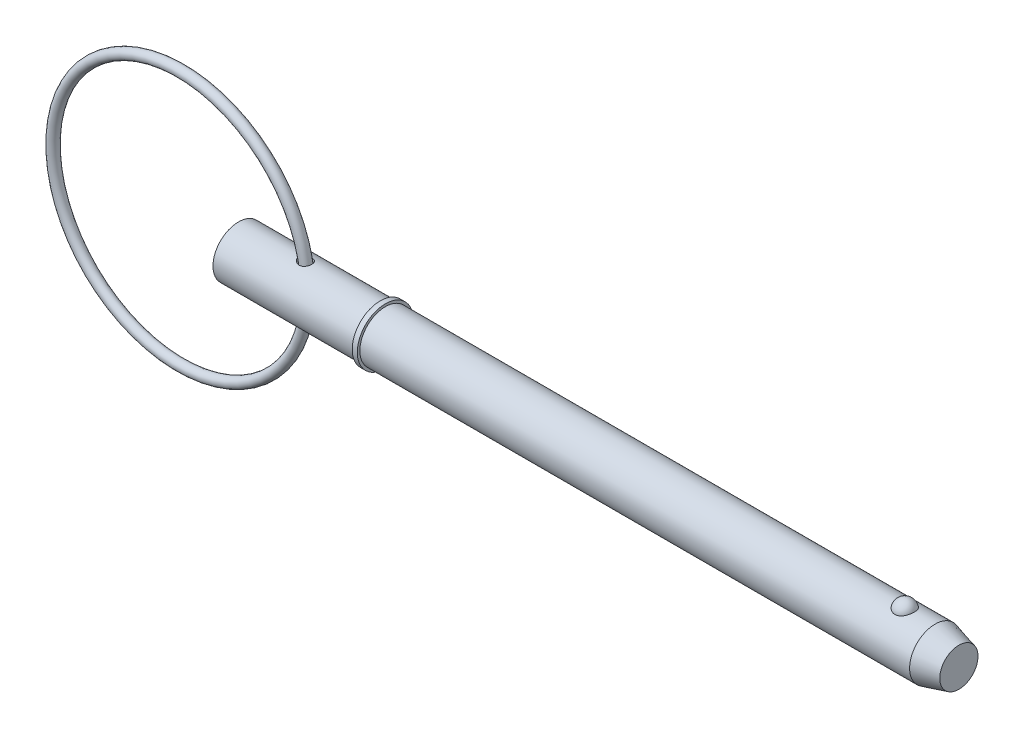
ISO-10303-21;
HEADER;
FILE_DESCRIPTION(('STEP AP214'),'2;1');
FILE_NAME('part.step','',(''),(''),'','','');
FILE_SCHEMA(('AUTOMOTIVE_DESIGN { 1 0 10303 214 1 1 1 1 }'));
ENDSEC;
DATA;
#1=APPLICATION_CONTEXT('core data for automotive mechanical design processes');
#2=APPLICATION_PROTOCOL_DEFINITION('international standard','automotive_design',2000,#1);
#3=PRODUCT_CONTEXT('',#1,'mechanical');
#4=PRODUCT('Part','Part','',(#3));
#5=PRODUCT_RELATED_PRODUCT_CATEGORY('part','',(#4));
#6=PRODUCT_DEFINITION_FORMATION('','',#4);
#7=PRODUCT_DEFINITION_CONTEXT('part definition',#1,'design');
#8=PRODUCT_DEFINITION('design','',#6,#7);
#9=PRODUCT_DEFINITION_SHAPE('','',#8);
#10=(LENGTH_UNIT() NAMED_UNIT(*) SI_UNIT(.MILLI.,.METRE.));
#11=(NAMED_UNIT(*) PLANE_ANGLE_UNIT() SI_UNIT($,.RADIAN.));
#12=(NAMED_UNIT(*) SI_UNIT($,.STERADIAN.) SOLID_ANGLE_UNIT());
#13=UNCERTAINTY_MEASURE_WITH_UNIT(LENGTH_MEASURE(1.E-05),#10,'distance_accuracy_value','');
#14=(GEOMETRIC_REPRESENTATION_CONTEXT(3) GLOBAL_UNCERTAINTY_ASSIGNED_CONTEXT((#13)) GLOBAL_UNIT_ASSIGNED_CONTEXT((#10,
#11,#12)) REPRESENTATION_CONTEXT('',''));
#15=CARTESIAN_POINT('',(0.,0.,0.));
#16=DIRECTION('',(0.,0.,1.));
#17=DIRECTION('',(1.,0.,0.));
#18=AXIS2_PLACEMENT_3D('',#15,#16,#17);
#19=CARTESIAN_POINT('',(-7.21857545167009,0.,0.));
#20=DIRECTION('',(0.,0.,1.));
#21=DIRECTION('',(1.,0.,0.));
#22=AXIS2_PLACEMENT_3D('',#19,#20,#21);
#23=TOROIDAL_SURFACE('',#22,15.875,0.634999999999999);
#24=CARTESIAN_POINT('',(9.29142454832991,0.,0.));
#25=VERTEX_POINT('',#24);
#26=VERTEX_LOOP('',#25);
#27=FACE_BOUND('',#26,.T.);
#28=ADVANCED_FACE('P0_F12',(#27),#23,.T.);
#29=CLOSED_SHELL('',(#28));
#30=MANIFOLD_SOLID_BREP('P0_B1',#29);
#31=CARTESIAN_POINT('',(0.,0.,0.));
#32=DIRECTION('',(1.,0.,0.));
#33=DIRECTION('',(0.,0.,-1.));
#34=AXIS2_PLACEMENT_3D('',#31,#32,#33);
#35=CYLINDRICAL_SURFACE('',#34,3.175);
#36=CARTESIAN_POINT('',(7.61208756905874,3.1556298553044,-0.35017883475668));
#37=CARTESIAN_POINT('',(7.63371620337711,3.15106857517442,-0.391277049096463));
#38=CARTESIAN_POINT('',(7.65900587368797,3.14590738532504,-0.430417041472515));
#39=CARTESIAN_POINT('',(7.71586762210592,3.13499707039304,-0.503788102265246));
#40=CARTESIAN_POINT('',(7.74745045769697,3.12924694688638,-0.538010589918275));
#41=CARTESIAN_POINT('',(7.81573449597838,3.11782384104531,-0.600675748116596));
#42=CARTESIAN_POINT('',(7.85242014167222,3.11215067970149,-0.629135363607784));
#43=CARTESIAN_POINT('',(7.9299616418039,3.10148180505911,-0.679784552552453));
#44=CARTESIAN_POINT('',(7.97081650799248,3.0964859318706,-0.701975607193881));
#45=CARTESIAN_POINT('',(8.05731415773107,3.08756286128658,-0.740259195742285));
#46=CARTESIAN_POINT('',(8.10308043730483,3.08368396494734,-0.756085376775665));
#47=CARTESIAN_POINT('',(8.19675033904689,3.07777545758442,-0.779791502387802));
#48=CARTESIAN_POINT('',(8.24465368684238,3.07574560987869,-0.787672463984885));
#49=CARTESIAN_POINT('',(8.33978659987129,3.07388057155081,-0.794919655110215));
#50=CARTESIAN_POINT('',(8.38699681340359,3.07398484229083,-0.794520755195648));
#51=CARTESIAN_POINT('',(8.48058476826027,3.07628376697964,-0.785572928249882));
#52=CARTESIAN_POINT('',(8.52696281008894,3.07847765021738,-0.777027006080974));
#53=CARTESIAN_POINT('',(8.61487038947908,3.08453758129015,-0.752595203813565));
#54=CARTESIAN_POINT('',(8.65652632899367,3.0883052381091,-0.737137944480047));
#55=CARTESIAN_POINT('',(8.73650065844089,3.09706199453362,-0.69943165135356));
#56=CARTESIAN_POINT('',(8.77481931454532,3.10205099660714,-0.677183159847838));
#57=CARTESIAN_POINT('',(8.84638246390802,3.11258194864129,-0.62697851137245));
#58=CARTESIAN_POINT('',(8.87970556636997,3.11811239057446,-0.599131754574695));
#59=CARTESIAN_POINT('',(8.94123162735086,3.12919300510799,-0.538266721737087));
#60=CARTESIAN_POINT('',(8.96943428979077,3.1347431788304,-0.505248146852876));
#61=CARTESIAN_POINT('',(9.02036334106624,3.14533698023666,-0.434482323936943));
#62=CARTESIAN_POINT('',(9.04301290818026,3.15037299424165,-0.396678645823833));
#63=CARTESIAN_POINT('',(9.08180072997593,3.15931021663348,-0.317742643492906));
#64=CARTESIAN_POINT('',(9.0979387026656,3.1632113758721,-0.27661017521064));
#65=CARTESIAN_POINT('',(9.12343544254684,3.16949230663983,-0.191753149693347));
#66=CARTESIAN_POINT('',(9.13272827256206,3.17185725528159,-0.148007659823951));
#67=CARTESIAN_POINT('',(9.14405176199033,3.17475043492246,-0.0595274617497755));
#68=CARTESIAN_POINT('',(9.14608246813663,3.17527867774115,-0.0147927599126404));
#69=CARTESIAN_POINT('',(9.1428335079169,3.1744420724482,0.0743443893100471));
#70=CARTESIAN_POINT('',(9.13756166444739,3.17307925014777,0.118747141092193));
#71=CARTESIAN_POINT('',(9.11985162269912,3.1686108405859,0.206009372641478));
#72=CARTESIAN_POINT('',(9.10741326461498,3.16550521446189,0.248868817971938));
#73=CARTESIAN_POINT('',(9.07566875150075,3.1578851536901,0.331849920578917));
#74=CARTESIAN_POINT('',(9.05635986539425,3.15337015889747,0.371970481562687));
#75=CARTESIAN_POINT('',(9.01134716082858,3.14342392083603,0.448324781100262));
#76=CARTESIAN_POINT('',(8.98564319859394,3.13799265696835,0.484558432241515));
#77=CARTESIAN_POINT('',(8.92847529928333,3.12681455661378,0.552114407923));
#78=CARTESIAN_POINT('',(8.89701024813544,3.12106765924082,0.583435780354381));
#79=CARTESIAN_POINT('',(8.82914631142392,3.10991074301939,0.640250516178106));
#80=CARTESIAN_POINT('',(8.79274799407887,3.10450068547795,0.665744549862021));
#81=CARTESIAN_POINT('',(8.71647895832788,3.09469918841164,0.709908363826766));
#82=CARTESIAN_POINT('',(8.6766541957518,3.09029650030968,0.728654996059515));
#83=CARTESIAN_POINT('',(8.59431583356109,3.08292493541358,0.759241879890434));
#84=CARTESIAN_POINT('',(8.55180254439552,3.07995589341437,0.771082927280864));
#85=CARTESIAN_POINT('',(8.46578539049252,3.07578939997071,0.787538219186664));
#86=CARTESIAN_POINT('',(8.42229655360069,3.07457372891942,0.792226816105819));
#87=CARTESIAN_POINT('',(8.33511786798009,3.07395008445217,0.794642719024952));
#88=CARTESIAN_POINT('',(8.29142799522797,3.07454233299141,0.792369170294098));
#89=CARTESIAN_POINT('',(8.20393675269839,3.07746038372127,0.7809593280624));
#90=CARTESIAN_POINT('',(8.16015857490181,3.07982804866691,0.771657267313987));
#91=CARTESIAN_POINT('',(8.07467704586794,3.08604667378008,0.746397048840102));
#92=CARTESIAN_POINT('',(8.03297433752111,3.08989809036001,0.730436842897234));
#93=CARTESIAN_POINT('',(7.95039160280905,3.09890222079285,0.691270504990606));
#94=CARTESIAN_POINT('',(7.90968495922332,3.10411517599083,0.667712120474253));
#95=CARTESIAN_POINT('',(7.83271969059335,3.1151281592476,0.614283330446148));
#96=CARTESIAN_POINT('',(7.79646250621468,3.12092837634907,0.584410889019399));
#97=CARTESIAN_POINT('',(7.72857688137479,3.13262084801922,0.518141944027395));
#98=CARTESIAN_POINT('',(7.69709348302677,3.13851156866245,0.481595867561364));
#99=CARTESIAN_POINT('',(7.64110131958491,3.14951669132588,0.403390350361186));
#100=CARTESIAN_POINT('',(7.61658964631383,3.15463141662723,0.361733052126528));
#101=CARTESIAN_POINT('',(7.57680170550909,3.16317869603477,0.276844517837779));
#102=CARTESIAN_POINT('',(7.56109307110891,3.16668805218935,0.233824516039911));
#103=CARTESIAN_POINT('',(7.53774475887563,3.17196948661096,0.145544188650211));
#104=CARTESIAN_POINT('',(7.53010042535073,3.17374256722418,0.100285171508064));
#105=CARTESIAN_POINT('',(7.52361520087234,3.17524561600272,0.0131362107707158));
#106=CARTESIAN_POINT('',(7.52405785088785,3.17514186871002,-0.0286991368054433));
#107=CARTESIAN_POINT('',(7.53198606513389,3.17330730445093,-0.11163297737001));
#108=CARTESIAN_POINT('',(7.53946515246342,3.17157798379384,-0.152732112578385));
#109=CARTESIAN_POINT('',(7.55761776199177,3.16747587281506,-0.220170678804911));
#110=CARTESIAN_POINT('',(7.56650761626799,3.16548510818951,-0.24703103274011));
#111=CARTESIAN_POINT('',(7.58717790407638,3.16094651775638,-0.299561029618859));
#112=CARTESIAN_POINT('',(7.59895820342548,3.15839871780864,-0.325230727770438));
#113=CARTESIAN_POINT('',(7.61208756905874,3.1556298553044,-0.35017883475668));
#114=B_SPLINE_CURVE_WITH_KNOTS('',3,(#36,#37,#38,#39,#40,#41,#42,#43,#44,#45,#46,#47,#48,#49,
#50,#51,#52,#53,#54,#55,#56,#57,#58,#59,#60,#61,#62,#63,#64,#65,#66,#67,#68,#69,#70,#71,#72,#73,
#74,#75,#76,#77,#78,#79,#80,#81,#82,#83,#84,#85,#86,#87,#88,#89,#90,#91,#92,#93,#94,#95,#96,#97,
#98,#99,#100,#101,#102,#103,#104,#105,#106,#107,#108,#109,#110,#111,#112,#113),.UNSPECIFIED.,
.T.,.F.,(4,2,2,2,2,2,2,2,2,2,2,2,2,2,2,2,2,2,2,2,2,2,2,2,2,2,2,2,2,2,2,2,2,2,2,2,2,2,4),(0.,
0.139884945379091,0.280011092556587,0.419719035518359,0.559393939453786,0.704422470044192,
0.849432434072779,0.990334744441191,1.13118510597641,1.26430449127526,1.39741324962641,
1.52813722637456,1.65886875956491,1.79131797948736,1.92377293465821,2.05748767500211,
2.19120155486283,2.32477230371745,2.45834603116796,2.5919729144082,2.72560280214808,
2.8592585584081,2.9928989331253,3.12496502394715,3.25701589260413,3.3876844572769,
3.51836906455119,3.65223598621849,3.78614411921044,3.92746618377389,4.06883388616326,
4.21388116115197,4.35886784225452,4.4959119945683,4.63287698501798,4.75777153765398,
4.88255123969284,4.9674704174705,5.05238565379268),.UNSPECIFIED.);
#115=CARTESIAN_POINT('',(7.61208756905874,3.1556298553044,-0.35017883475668));
#116=VERTEX_POINT('',#115);
#117=EDGE_CURVE('P1_E42',#116,#116,#114,.T.);
#118=ORIENTED_EDGE('',*,*,#117,.T.);
#119=EDGE_LOOP('',(#118));
#120=FACE_BOUND('',#119,.T.);
#121=CARTESIAN_POINT('',(0.,0.,0.));
#122=DIRECTION('',(1.,0.,0.));
#123=DIRECTION('',(0.,0.,-1.));
#124=AXIS2_PLACEMENT_3D('',#121,#122,#123);
#125=CIRCLE('',#124,3.175);
#126=CARTESIAN_POINT('',(0.,0.,-3.175));
#127=VERTEX_POINT('',#126);
#128=EDGE_CURVE('P1_E9',#127,#127,#125,.T.);
#129=ORIENTED_EDGE('',*,*,#128,.T.);
#130=EDGE_LOOP('',(#129));
#131=FACE_BOUND('',#130,.T.);
#132=CARTESIAN_POINT('',(17.655,0.,0.));
#133=DIRECTION('',(1.,0.,0.));
#134=DIRECTION('',(0.,0.,-1.));
#135=AXIS2_PLACEMENT_3D('',#132,#133,#134);
#136=CIRCLE('',#135,3.175);
#137=CARTESIAN_POINT('',(17.655,0.,-3.175));
#138=VERTEX_POINT('',#137);
#139=EDGE_CURVE('P1_E25',#138,#138,#136,.T.);
#140=ORIENTED_EDGE('',*,*,#139,.F.);
#141=EDGE_LOOP('',(#140));
#142=FACE_BOUND('',#141,.T.);
#143=CARTESIAN_POINT('',(7.61208756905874,-3.1556298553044,-0.35017883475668));
#144=CARTESIAN_POINT('',(7.59286963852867,-3.15968249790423,-0.313658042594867));
#145=CARTESIAN_POINT('',(7.57653057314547,-3.16326353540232,-0.275569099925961));
#146=CARTESIAN_POINT('',(7.55026251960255,-3.16911690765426,-0.197144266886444));
#147=CARTESIAN_POINT('',(7.5403309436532,-3.17138977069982,-0.156809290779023));
#148=CARTESIAN_POINT('',(7.52732229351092,-3.17438133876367,-0.0748996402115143));
#149=CARTESIAN_POINT('',(7.52425928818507,-3.17509685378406,-0.0333225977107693));
#150=CARTESIAN_POINT('',(7.52518511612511,-3.17488190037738,0.0497488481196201));
#151=CARTESIAN_POINT('',(7.52917391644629,-3.17395143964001,0.0912432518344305));
#152=CARTESIAN_POINT('',(7.5438119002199,-3.17059494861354,0.171876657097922));
#153=CARTESIAN_POINT('',(7.55428987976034,-3.16820738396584,0.211048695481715));
#154=CARTESIAN_POINT('',(7.58129107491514,-3.16221942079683,0.287144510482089));
#155=CARTESIAN_POINT('',(7.59781536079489,-3.15861880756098,0.324067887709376));
#156=CARTESIAN_POINT('',(7.63709105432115,-3.15038497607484,0.39633030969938));
#157=CARTESIAN_POINT('',(7.66007308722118,-3.14571500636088,0.431539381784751));
#158=CARTESIAN_POINT('',(7.71115516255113,-3.1358897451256,0.497945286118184));
#159=CARTESIAN_POINT('',(7.73925713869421,-3.13073427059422,0.529140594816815));
#160=CARTESIAN_POINT('',(7.80245490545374,-3.11995925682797,0.589491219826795));
#161=CARTESIAN_POINT('',(7.83794667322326,-3.11433841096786,0.618232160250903));
#162=CARTESIAN_POINT('',(7.91311816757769,-3.10367079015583,0.669735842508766));
#163=CARTESIAN_POINT('',(7.9527994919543,-3.09862423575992,0.692496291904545));
#164=CARTESIAN_POINT('',(8.0376108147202,-3.08940933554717,0.732544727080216));
#165=CARTESIAN_POINT('',(8.08291928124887,-3.08530306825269,0.749471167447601));
#166=CARTESIAN_POINT('',(8.17586222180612,-3.07887185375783,0.775470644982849));
#167=CARTESIAN_POINT('',(8.22349631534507,-3.07654661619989,0.784544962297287));
#168=CARTESIAN_POINT('',(8.31855368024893,-3.0740583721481,0.794238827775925));
#169=CARTESIAN_POINT('',(8.365955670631,-3.0738459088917,0.795051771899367));
#170=CARTESIAN_POINT('',(8.46014660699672,-3.07554059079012,0.788471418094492));
#171=CARTESIAN_POINT('',(8.50693577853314,-3.07744693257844,0.781081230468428));
#172=CARTESIAN_POINT('',(8.59580031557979,-3.08301185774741,0.75880456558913));
#173=CARTESIAN_POINT('',(8.63799306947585,-3.0865668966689,0.744358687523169));
#174=CARTESIAN_POINT('',(8.71919510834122,-3.09498125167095,0.708556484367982));
#175=CARTESIAN_POINT('',(8.75820469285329,-3.09984044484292,0.687200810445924));
#176=CARTESIAN_POINT('',(8.83112932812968,-3.11018970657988,0.638704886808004));
#177=CARTESIAN_POINT('',(8.86513521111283,-3.11566412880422,0.6116975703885));
#178=CARTESIAN_POINT('',(8.92814452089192,-3.1267232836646,0.552389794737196));
#179=CARTESIAN_POINT('',(8.95714769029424,-3.13230802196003,0.520089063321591));
#180=CARTESIAN_POINT('',(9.00975680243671,-3.1430519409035,0.450661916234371));
#181=CARTESIAN_POINT('',(9.03329284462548,-3.14820512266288,0.413481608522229));
#182=CARTESIAN_POINT('',(9.07393955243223,-3.15745247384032,0.335639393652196));
#183=CARTESIAN_POINT('',(9.09104990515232,-3.16154659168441,0.294977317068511));
#184=CARTESIAN_POINT('',(9.11857731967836,-3.16827429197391,0.21085639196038));
#185=CARTESIAN_POINT('',(9.12892253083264,-3.1708921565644,0.167372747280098));
#186=CARTESIAN_POINT('',(9.14237674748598,-3.17431758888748,0.0792307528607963));
#187=CARTESIAN_POINT('',(9.14548579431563,-3.17512516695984,0.0345724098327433));
#188=CARTESIAN_POINT('',(9.14439142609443,-3.17484319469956,-0.0546175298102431));
#189=CARTESIAN_POINT('',(9.14019308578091,-3.17375496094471,-0.0991491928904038));
#190=CARTESIAN_POINT('',(9.12459742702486,-3.16980106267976,-0.186852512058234));
#191=CARTESIAN_POINT('',(9.11319997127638,-3.16693536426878,-0.230024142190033));
#192=CARTESIAN_POINT('',(9.08348483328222,-3.15973571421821,-0.313789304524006));
#193=CARTESIAN_POINT('',(9.06516665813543,-3.15540165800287,-0.354382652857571));
#194=CARTESIAN_POINT('',(9.02205745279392,-3.14573679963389,-0.431845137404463));
#195=CARTESIAN_POINT('',(8.99726624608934,-3.14040597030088,-0.468714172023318));
#196=CARTESIAN_POINT('',(8.94180687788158,-3.12933254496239,-0.53770470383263));
#197=CARTESIAN_POINT('',(8.91113471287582,-3.12358967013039,-0.569822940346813));
#198=CARTESIAN_POINT('',(8.84472020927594,-3.11234460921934,-0.628352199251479));
#199=CARTESIAN_POINT('',(8.80897839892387,-3.10684239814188,-0.654763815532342));
#200=CARTESIAN_POINT('',(8.73381844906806,-3.0967672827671,-0.700864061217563));
#201=CARTESIAN_POINT('',(8.69444454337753,-3.09218491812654,-0.720622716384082));
#202=CARTESIAN_POINT('',(8.61282389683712,-3.08439406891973,-0.75327416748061));
#203=CARTESIAN_POINT('',(8.57057751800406,-3.08118541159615,-0.766167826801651));
#204=CARTESIAN_POINT('',(8.48495851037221,-3.07651651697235,-0.784705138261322));
#205=CARTESIAN_POINT('',(8.44160497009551,-3.07503616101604,-0.7904322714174));
#206=CARTESIAN_POINT('',(8.35452054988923,-3.07388232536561,-0.794907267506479));
#207=CARTESIAN_POINT('',(8.31078963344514,-3.07420902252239,-0.793654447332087));
#208=CARTESIAN_POINT('',(8.22319164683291,-3.07661365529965,-0.784281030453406));
#209=CARTESIAN_POINT('',(8.17934121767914,-3.07872844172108,-0.776015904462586));
#210=CARTESIAN_POINT('',(8.09354825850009,-3.08448489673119,-0.752807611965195));
#211=CARTESIAN_POINT('',(8.05160636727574,-3.08812707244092,-0.737862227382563));
#212=CARTESIAN_POINT('',(7.9683964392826,-3.09676294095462,-0.700760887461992));
#213=CARTESIAN_POINT('',(7.92729071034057,-3.10181965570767,-0.678255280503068));
#214=CARTESIAN_POINT('',(7.84934481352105,-3.11260576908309,-0.626894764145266));
#215=CARTESIAN_POINT('',(7.81250545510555,-3.11833529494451,-0.598038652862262));
#216=CARTESIAN_POINT('',(7.74486652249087,-3.12971026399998,-0.535287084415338));
#217=CARTESIAN_POINT('',(7.71395414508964,-3.13535486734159,-0.50151327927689));
#218=CARTESIAN_POINT('',(7.65821444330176,-3.14606907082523,-0.429192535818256));
#219=CARTESIAN_POINT('',(7.63338346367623,-3.15113901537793,-0.390648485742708));
#220=CARTESIAN_POINT('',(7.61208756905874,-3.1556298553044,-0.35017883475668));
#221=B_SPLINE_CURVE_WITH_KNOTS('',3,(#143,#144,#145,#146,#147,#148,#149,#150,#151,#152,#153,
#154,#155,#156,#157,#158,#159,#160,#161,#162,#163,#164,#165,#166,#167,#168,#169,#170,#171,#172,
#173,#174,#175,#176,#177,#178,#179,#180,#181,#182,#183,#184,#185,#186,#187,#188,#189,#190,#191,
#192,#193,#194,#195,#196,#197,#198,#199,#200,#201,#202,#203,#204,#205,#206,#207,#208,#209,#210,
#211,#212,#213,#214,#215,#216,#217,#218,#219,#220),.UNSPECIFIED.,.T.,.F.,(4,2,2,2,2,2,2,2,2,2,2,
2,2,2,2,2,2,2,2,2,2,2,2,2,2,2,2,2,2,2,2,2,2,2,2,2,2,2,4),(0.,0.124257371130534,0.24846452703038,
0.372925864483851,0.497386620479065,0.618695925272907,0.740026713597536,0.86640919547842,
0.992839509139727,1.13028244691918,1.26777799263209,1.41269245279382,1.55758328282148,
1.69907422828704,1.84051154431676,1.97406862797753,2.10761312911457,2.23831247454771,
2.36901854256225,2.5013136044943,2.63361510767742,2.76729986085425,2.90098385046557,
3.03457503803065,3.16816877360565,3.3017720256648,3.43537892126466,3.56907709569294,
3.70276134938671,3.83499098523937,3.96720398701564,4.09786208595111,4.22853297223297,
4.36196440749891,4.49544017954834,4.63621591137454,4.77701830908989,4.91479418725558,
5.05248705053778),.UNSPECIFIED.);
#222=CARTESIAN_POINT('',(7.61208756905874,-3.1556298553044,-0.35017883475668));
#223=VERTEX_POINT('',#222);
#224=EDGE_CURVE('P1_E17',#223,#223,#221,.T.);
#225=ORIENTED_EDGE('',*,*,#224,.T.);
#226=EDGE_LOOP('',(#225));
#227=FACE_BOUND('',#226,.T.);
#228=ADVANCED_FACE('P1_F13',(#120,#131,#142,#227),#35,.T.);
#229=CARTESIAN_POINT('',(0.,0.,0.));
#230=DIRECTION('',(1.,0.,0.));
#231=DIRECTION('',(0.,0.,-1.));
#232=AXIS2_PLACEMENT_3D('',#229,#230,#231);
#233=CYLINDRICAL_SURFACE('',#232,3.175);
#234=CARTESIAN_POINT('',(86.7476846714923,0.,0.));
#235=DIRECTION('',(1.,0.,0.));
#236=DIRECTION('',(0.,0.,-1.));
#237=AXIS2_PLACEMENT_3D('',#234,#235,#236);
#238=CIRCLE('',#237,3.175);
#239=CARTESIAN_POINT('',(86.7476846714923,0.,-3.175));
#240=VERTEX_POINT('',#239);
#241=EDGE_CURVE('P1_E99',#240,#240,#238,.T.);
#242=ORIENTED_EDGE('',*,*,#241,.F.);
#243=EDGE_LOOP('',(#242));
#244=FACE_BOUND('',#243,.T.);
#245=CARTESIAN_POINT('',(18.29,0.,0.));
#246=DIRECTION('',(1.,0.,0.));
#247=DIRECTION('',(0.,0.,-1.));
#248=AXIS2_PLACEMENT_3D('',#245,#246,#247);
#249=CIRCLE('',#248,3.175);
#250=CARTESIAN_POINT('',(18.29,0.,-3.175));
#251=VERTEX_POINT('',#250);
#252=EDGE_CURVE('P1_E96',#251,#251,#249,.T.);
#253=ORIENTED_EDGE('',*,*,#252,.T.);
#254=EDGE_LOOP('',(#253));
#255=FACE_BOUND('',#254,.T.);
#256=CARTESIAN_POINT('',(82.9757276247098,2.92898950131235,1.22541646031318));
#257=CARTESIAN_POINT('',(82.912316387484,2.92899434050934,1.22541146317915));
#258=CARTESIAN_POINT('',(82.8487979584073,2.93112688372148,1.22034641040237));
#259=CARTESIAN_POINT('',(82.7235306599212,2.93942752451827,1.20020949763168));
#260=CARTESIAN_POINT('',(82.6617869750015,2.94560639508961,1.18511092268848));
#261=CARTESIAN_POINT('',(82.5420651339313,2.96127115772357,1.14540352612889));
#262=CARTESIAN_POINT('',(82.4840775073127,2.97074831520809,1.12081980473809));
#263=CARTESIAN_POINT('',(82.3731943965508,2.99197584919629,1.06285154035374));
#264=CARTESIAN_POINT('',(82.3202966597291,3.0037252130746,1.02947091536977));
#265=CARTESIAN_POINT('',(82.2192688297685,3.02865714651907,0.953674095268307));
#266=CARTESIAN_POINT('',(82.1713240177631,3.04187163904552,0.911021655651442));
#267=CARTESIAN_POINT('',(82.0830360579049,3.06808741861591,0.818400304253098));
#268=CARTESIAN_POINT('',(82.0426952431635,3.08108863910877,0.768429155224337));
#269=CARTESIAN_POINT('',(81.9688039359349,3.10614903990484,0.660064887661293));
#270=CARTESIAN_POINT('',(81.9356330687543,3.11814104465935,0.60139688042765));
#271=CARTESIAN_POINT('',(81.8791190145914,3.13926931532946,0.479026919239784));
#272=CARTESIAN_POINT('',(81.8557764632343,3.14840539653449,0.415324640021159));
#273=CARTESIAN_POINT('',(81.8191785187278,3.16298160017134,0.283885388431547));
#274=CARTESIAN_POINT('',(81.8060407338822,3.16837855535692,0.216110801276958));
#275=CARTESIAN_POINT('',(81.7905676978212,3.17475386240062,0.0791367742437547));
#276=CARTESIAN_POINT('',(81.788232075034,3.17573236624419,0.00993738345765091));
#277=CARTESIAN_POINT('',(81.7943886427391,3.17318075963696,-0.127420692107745));
#278=CARTESIAN_POINT('',(81.8028073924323,3.16968122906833,-0.195583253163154));
#279=CARTESIAN_POINT('',(81.8301752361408,3.1585790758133,-0.329413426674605));
#280=CARTESIAN_POINT('',(81.8491245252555,3.15097637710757,-0.395080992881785));
#281=CARTESIAN_POINT('',(81.8972057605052,3.13242485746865,-0.522180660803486));
#282=CARTESIAN_POINT('',(81.9263524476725,3.12147119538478,-0.58360647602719));
#283=CARTESIAN_POINT('',(81.9942352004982,3.09734973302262,-0.700436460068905));
#284=CARTESIAN_POINT('',(82.032972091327,3.08418174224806,-0.755840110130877));
#285=CARTESIAN_POINT('',(82.1194771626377,3.05694884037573,-0.859404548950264));
#286=CARTESIAN_POINT('',(82.1672961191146,3.0428791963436,-0.907521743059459));
#287=CARTESIAN_POINT('',(82.2707353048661,3.01548927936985,-0.994758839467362));
#288=CARTESIAN_POINT('',(82.3263549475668,3.00216895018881,-1.03387941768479));
#289=CARTESIAN_POINT('',(82.4428093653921,2.97810316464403,-1.1012659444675));
#290=CARTESIAN_POINT('',(82.5035182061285,2.96731170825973,-1.12973256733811));
#291=CARTESIAN_POINT('',(82.6293712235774,2.94928934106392,-1.17598467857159));
#292=CARTESIAN_POINT('',(82.6945137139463,2.94205708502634,-1.19377420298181));
#293=CARTESIAN_POINT('',(82.8238562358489,2.93233065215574,-1.21746387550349));
#294=CARTESIAN_POINT('',(82.8879385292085,2.92961621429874,-1.2239176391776));
#295=CARTESIAN_POINT('',(83.0163375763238,2.92855752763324,-1.22644976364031));
#296=CARTESIAN_POINT('',(83.0806542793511,2.93021238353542,-1.22253024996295));
#297=CARTESIAN_POINT('',(83.2055239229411,2.93756851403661,-1.20474140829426));
#298=CARTESIAN_POINT('',(83.266131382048,2.94313790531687,-1.19119621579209));
#299=CARTESIAN_POINT('',(83.3841106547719,2.95756226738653,-1.15491492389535));
#300=CARTESIAN_POINT('',(83.4414822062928,2.96641750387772,-1.13217808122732));
#301=CARTESIAN_POINT('',(83.5527699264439,2.98669918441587,-1.07755083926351));
#302=CARTESIAN_POINT('',(83.6065845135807,2.9981771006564,-1.04547308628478));
#303=CARTESIAN_POINT('',(83.7081473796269,3.02240235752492,-0.973220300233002));
#304=CARTESIAN_POINT('',(83.7558942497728,3.03514999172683,-0.933043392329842));
#305=CARTESIAN_POINT('',(83.8465817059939,3.06131230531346,-0.843372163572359));
#306=CARTESIAN_POINT('',(83.8891588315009,3.07472822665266,-0.793510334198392));
#307=CARTESIAN_POINT('',(83.9656765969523,3.10021106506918,-0.68724107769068));
#308=CARTESIAN_POINT('',(83.9996156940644,3.1122777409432,-0.630832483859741));
#309=CARTESIAN_POINT('',(84.0591209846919,3.134208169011,-0.511059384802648));
#310=CARTESIAN_POINT('',(84.0843892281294,3.14399040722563,-0.447531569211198));
#311=CARTESIAN_POINT('',(84.1245117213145,3.15983820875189,-0.316827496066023));
#312=CARTESIAN_POINT('',(84.1393659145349,3.16590375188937,-0.249651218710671));
#313=CARTESIAN_POINT('',(84.158358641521,3.17370076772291,-0.113549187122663));
#314=CARTESIAN_POINT('',(84.1624966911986,3.17543204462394,-0.0446233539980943));
#315=CARTESIAN_POINT('',(84.1599697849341,3.17438372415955,0.0929938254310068));
#316=CARTESIAN_POINT('',(84.153305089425,3.17160423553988,0.161685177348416));
#317=CARTESIAN_POINT('',(84.1293754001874,3.1618438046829,0.296502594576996));
#318=CARTESIAN_POINT('',(84.1121674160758,3.15488546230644,0.362640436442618));
#319=CARTESIAN_POINT('',(84.067547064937,3.1374889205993,0.490896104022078));
#320=CARTESIAN_POINT('',(84.0401339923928,3.12705048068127,0.553013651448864));
#321=CARTESIAN_POINT('',(83.9754626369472,3.10369139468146,0.671876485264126));
#322=CARTESIAN_POINT('',(83.9381467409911,3.09075634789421,0.728587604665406));
#323=CARTESIAN_POINT('',(83.8545246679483,3.06381731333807,0.83465359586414));
#324=CARTESIAN_POINT('',(83.8082189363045,3.04981337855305,0.884008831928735));
#325=CARTESIAN_POINT('',(83.7077184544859,3.02230423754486,0.973916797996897));
#326=CARTESIAN_POINT('',(83.653535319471,3.00879833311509,1.01448227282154));
#327=CARTESIAN_POINT('',(83.5385299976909,2.98383625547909,1.08571550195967));
#328=CARTESIAN_POINT('',(83.4777053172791,2.97238085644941,1.11637952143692));
#329=CARTESIAN_POINT('',(83.3533690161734,2.95329063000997,1.16592590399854));
#330=CARTESIAN_POINT('',(83.2900230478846,2.94553738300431,1.18517901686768));
#331=CARTESIAN_POINT('',(83.1607664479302,2.93425566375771,1.21284802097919));
#332=CARTESIAN_POINT('',(83.0948641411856,2.93071450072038,1.22129647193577));
#333=CARTESIAN_POINT('',(83.011116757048,2.92915255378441,1.22502505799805));
#334=CARTESIAN_POINT('',(82.9934263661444,2.92898815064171,1.2254178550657));
#335=CARTESIAN_POINT('',(82.9757276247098,2.92898950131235,1.22541646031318));
#336=B_SPLINE_CURVE_WITH_KNOTS('',3,(#256,#257,#258,#259,#260,#261,#262,#263,#264,#265,#266,
#267,#268,#269,#270,#271,#272,#273,#274,#275,#276,#277,#278,#279,#280,#281,#282,#283,#284,#285,
#286,#287,#288,#289,#290,#291,#292,#293,#294,#295,#296,#297,#298,#299,#300,#301,#302,#303,#304,
#305,#306,#307,#308,#309,#310,#311,#312,#313,#314,#315,#316,#317,#318,#319,#320,#321,#322,#323,
#324,#325,#326,#327,#328,#329,#330,#331,#332,#333,#334,#335),.UNSPECIFIED.,.T.,.F.,(4,2,2,2,2,2,
2,2,2,2,2,2,2,2,2,2,2,2,2,2,2,2,2,2,2,2,2,2,2,2,2,2,2,2,2,2,2,2,2,4),(0.,0.190186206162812,
0.38088083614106,0.571074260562,0.761183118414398,0.956866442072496,1.15260970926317,
1.35701770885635,1.56143892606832,1.76818248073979,1.97491892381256,2.18025109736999,
2.38558707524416,2.59122111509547,2.7968728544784,3.00371012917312,3.21053185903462,
3.41323429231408,3.61586005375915,3.80828192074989,4.00066436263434,4.18685798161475,
4.37306665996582,4.56330302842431,4.75358348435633,4.9534528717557,5.15335793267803,
5.35957003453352,5.56578325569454,5.77200579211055,5.9782233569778,6.18333558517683,
6.38846199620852,6.59480900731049,6.80114579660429,7.00718137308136,7.21329457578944,
7.41228022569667,7.61066481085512,7.66374777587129),.UNSPECIFIED.);
#337=CARTESIAN_POINT('',(82.9757276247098,2.92898950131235,1.22541646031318));
#338=VERTEX_POINT('',#337);
#339=EDGE_CURVE('P1_E34',#338,#338,#336,.T.);
#340=ORIENTED_EDGE('',*,*,#339,.T.);
#341=EDGE_LOOP('',(#340));
#342=FACE_BOUND('',#341,.T.);
#343=ADVANCED_FACE('P1_F46',(#244,#255,#342),#233,.T.);
#344=CARTESIAN_POINT('',(0.,0.,0.));
#345=DIRECTION('',(-1.,0.,0.));
#346=DIRECTION('',(0.,0.,1.));
#347=AXIS2_PLACEMENT_3D('',#344,#345,#346);
#348=PLANE('',#347);
#349=ORIENTED_EDGE('',*,*,#128,.F.);
#350=EDGE_LOOP('',(#349));
#351=FACE_BOUND('',#350,.T.);
#352=ADVANCED_FACE('P1_F15',(#351),#348,.T.);
#353=CARTESIAN_POINT('',(17.655,3.175,0.));
#354=DIRECTION('',(-1.,0.,0.));
#355=DIRECTION('',(0.,0.,1.));
#356=AXIS2_PLACEMENT_3D('',#353,#354,#355);
#357=PLANE('',#356);
#358=ORIENTED_EDGE('',*,*,#139,.T.);
#359=EDGE_LOOP('',(#358));
#360=FACE_BOUND('',#359,.T.);
#361=CARTESIAN_POINT('',(17.655,0.,0.));
#362=DIRECTION('',(1.,0.,0.));
#363=DIRECTION('',(0.,0.,-1.));
#364=AXIS2_PLACEMENT_3D('',#361,#362,#363);
#365=CIRCLE('',#364,3.4925);
#366=CARTESIAN_POINT('',(17.655,0.,-3.4925));
#367=VERTEX_POINT('',#366);
#368=EDGE_CURVE('P1_E30',#367,#367,#365,.T.);
#369=ORIENTED_EDGE('',*,*,#368,.F.);
#370=EDGE_LOOP('',(#369));
#371=FACE_BOUND('',#370,.T.);
#372=ADVANCED_FACE('P1_F81',(#360,#371),#357,.T.);
#373=CARTESIAN_POINT('',(0.,0.,0.));
#374=DIRECTION('',(1.,0.,0.));
#375=DIRECTION('',(0.,0.,-1.));
#376=AXIS2_PLACEMENT_3D('',#373,#374,#375);
#377=CYLINDRICAL_SURFACE('',#376,3.4925);
#378=ORIENTED_EDGE('',*,*,#368,.T.);
#379=EDGE_LOOP('',(#378));
#380=FACE_BOUND('',#379,.T.);
#381=CARTESIAN_POINT('',(18.29,0.,0.));
#382=DIRECTION('',(1.,0.,0.));
#383=DIRECTION('',(0.,0.,-1.));
#384=AXIS2_PLACEMENT_3D('',#381,#382,#383);
#385=CIRCLE('',#384,3.4925);
#386=CARTESIAN_POINT('',(18.29,0.,-3.4925));
#387=VERTEX_POINT('',#386);
#388=EDGE_CURVE('P1_E95',#387,#387,#385,.T.);
#389=ORIENTED_EDGE('',*,*,#388,.F.);
#390=EDGE_LOOP('',(#389));
#391=FACE_BOUND('',#390,.T.);
#392=ADVANCED_FACE('P1_F68',(#380,#391),#377,.T.);
#393=CARTESIAN_POINT('',(18.29,3.4925,0.));
#394=DIRECTION('',(1.,0.,0.));
#395=DIRECTION('',(0.,0.,-1.));
#396=AXIS2_PLACEMENT_3D('',#393,#394,#395);
#397=PLANE('',#396);
#398=ORIENTED_EDGE('',*,*,#388,.T.);
#399=EDGE_LOOP('',(#398));
#400=FACE_BOUND('',#399,.T.);
#401=ORIENTED_EDGE('',*,*,#252,.F.);
#402=EDGE_LOOP('',(#401));
#403=FACE_BOUND('',#402,.T.);
#404=ADVANCED_FACE('P1_F62',(#400,#403),#397,.T.);
#405=CARTESIAN_POINT('',(89.71,0.,0.));
#406=DIRECTION('',(-1.,0.,0.));
#407=DIRECTION('',(0.,0.,1.));
#408=AXIS2_PLACEMENT_3D('',#405,#406,#407);
#409=CONICAL_SURFACE('',#408,2.38125000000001,0.261799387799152);
#410=ORIENTED_EDGE('',*,*,#241,.T.);
#411=EDGE_LOOP('',(#410));
#412=FACE_BOUND('',#411,.T.);
#413=CARTESIAN_POINT('',(89.71,0.,0.));
#414=DIRECTION('',(1.,0.,0.));
#415=DIRECTION('',(0.,0.,-1.));
#416=AXIS2_PLACEMENT_3D('',#413,#414,#415);
#417=CIRCLE('',#416,2.38125000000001);
#418=CARTESIAN_POINT('',(89.71,0.,-2.38125000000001));
#419=VERTEX_POINT('',#418);
#420=EDGE_CURVE('P1_E41',#419,#419,#417,.T.);
#421=ORIENTED_EDGE('',*,*,#420,.F.);
#422=EDGE_LOOP('',(#421));
#423=FACE_BOUND('',#422,.T.);
#424=ADVANCED_FACE('P1_F59',(#412,#423),#409,.T.);
#425=CARTESIAN_POINT('',(89.71,2.38125000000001,0.));
#426=DIRECTION('',(1.,0.,0.));
#427=DIRECTION('',(0.,0.,-1.));
#428=AXIS2_PLACEMENT_3D('',#425,#426,#427);
#429=PLANE('',#428);
#430=ORIENTED_EDGE('',*,*,#420,.T.);
#431=EDGE_LOOP('',(#430));
#432=FACE_BOUND('',#431,.T.);
#433=ADVANCED_FACE('P1_F55',(#432),#429,.T.);
#434=CARTESIAN_POINT('',(82.9757276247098,2.85749999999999,0.));
#435=DIRECTION('',(-1.,0.,0.));
#436=DIRECTION('',(0.,1.,0.));
#437=AXIS2_PLACEMENT_3D('',#434,#435,#436);
#438=SPHERICAL_SURFACE('',#437,1.22749999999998);
#439=ORIENTED_EDGE('',*,*,#339,.F.);
#440=EDGE_LOOP('',(#439));
#441=FACE_BOUND('',#440,.T.);
#442=ADVANCED_FACE('P1_F50',(#441),#438,.T.);
#443=CARTESIAN_POINT('',(-7.21857545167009,0.,0.));
#444=DIRECTION('',(0.,0.,1.));
#445=DIRECTION('',(1.,0.,0.));
#446=AXIS2_PLACEMENT_3D('',#443,#444,#445);
#447=TOROIDAL_SURFACE('',#446,15.875,0.793749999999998);
#448=ORIENTED_EDGE('',*,*,#224,.F.);
#449=EDGE_LOOP('',(#448));
#450=FACE_BOUND('',#449,.T.);
#451=ORIENTED_EDGE('',*,*,#117,.F.);
#452=EDGE_LOOP('',(#451));
#453=FACE_BOUND('',#452,.T.);
#454=ADVANCED_FACE('P1_F54',(#450,#453),#447,.F.);
#455=CLOSED_SHELL('',(#228,#343,#352,#372,#392,#404,#424,#433,#442,#454));
#456=MANIFOLD_SOLID_BREP('P1_B1',#455);
#457=ADVANCED_BREP_SHAPE_REPRESENTATION('',(#18,#30,#456),#14);
#458=SHAPE_DEFINITION_REPRESENTATION(#9,#457);
ENDSEC;
END-ISO-10303-21;
